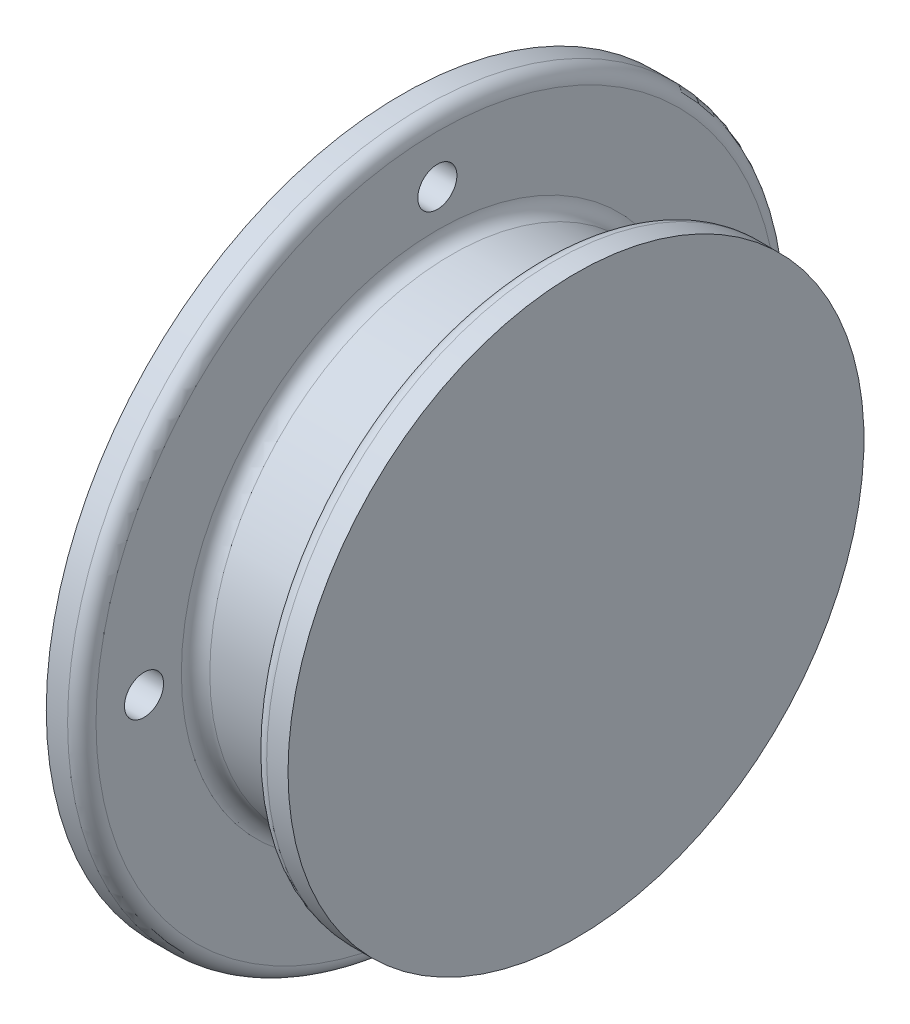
ISO-10303-21;
HEADER;
FILE_DESCRIPTION(('STEP AP214'),'2;1');
FILE_NAME('part.step','',(''),(''),'','','');
FILE_SCHEMA(('AUTOMOTIVE_DESIGN { 1 0 10303 214 1 1 1 1 }'));
ENDSEC;
DATA;
#1=APPLICATION_CONTEXT('core data for automotive mechanical design processes');
#2=APPLICATION_PROTOCOL_DEFINITION('international standard','automotive_design',2000,#1);
#3=PRODUCT_CONTEXT('',#1,'mechanical');
#4=PRODUCT('Part','Part','',(#3));
#5=PRODUCT_RELATED_PRODUCT_CATEGORY('part','',(#4));
#6=PRODUCT_DEFINITION_FORMATION('','',#4);
#7=PRODUCT_DEFINITION_CONTEXT('part definition',#1,'design');
#8=PRODUCT_DEFINITION('design','',#6,#7);
#9=PRODUCT_DEFINITION_SHAPE('','',#8);
#10=(LENGTH_UNIT() NAMED_UNIT(*) SI_UNIT(.MILLI.,.METRE.));
#11=(NAMED_UNIT(*) PLANE_ANGLE_UNIT() SI_UNIT($,.RADIAN.));
#12=(NAMED_UNIT(*) SI_UNIT($,.STERADIAN.) SOLID_ANGLE_UNIT());
#13=UNCERTAINTY_MEASURE_WITH_UNIT(LENGTH_MEASURE(1.E-05),#10,'distance_accuracy_value','');
#14=(GEOMETRIC_REPRESENTATION_CONTEXT(3) GLOBAL_UNCERTAINTY_ASSIGNED_CONTEXT((#13)) GLOBAL_UNIT_ASSIGNED_CONTEXT((#10,
#11,#12)) REPRESENTATION_CONTEXT('',''));
#15=CARTESIAN_POINT('',(0.,0.,0.));
#16=DIRECTION('',(0.,0.,1.));
#17=DIRECTION('',(1.,0.,0.));
#18=AXIS2_PLACEMENT_3D('',#15,#16,#17);
#19=CARTESIAN_POINT('',(423.5,0.,-15.9000000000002));
#20=DIRECTION('',(-1.,0.,0.));
#21=DIRECTION('',(0.,0.,1.));
#22=AXIS2_PLACEMENT_3D('',#19,#20,#21);
#23=PLANE('',#22);
#24=CARTESIAN_POINT('',(423.5,0.,-15.9000000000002));
#25=DIRECTION('',(-1.,0.,0.));
#26=DIRECTION('',(0.,0.,1.));
#27=AXIS2_PLACEMENT_3D('',#24,#25,#26);
#28=CIRCLE('',#27,65.);
#29=CARTESIAN_POINT('',(423.5,0.,49.0999999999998));
#30=VERTEX_POINT('',#29);
#31=EDGE_CURVE('E18',#30,#30,#28,.F.);
#32=ORIENTED_EDGE('',*,*,#31,.F.);
#33=EDGE_LOOP('',(#32));
#34=FACE_BOUND('',#33,.T.);
#35=ADVANCED_FACE('F14',(#34),#23,.T.);
#36=CARTESIAN_POINT('',(425.25,0.,-15.9000000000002));
#37=DIRECTION('',(-1.,0.,0.));
#38=DIRECTION('',(0.,0.,1.));
#39=AXIS2_PLACEMENT_3D('',#36,#37,#38);
#40=CYLINDRICAL_SURFACE('',#39,65.);
#41=CARTESIAN_POINT('',(427.,0.,-15.9000000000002));
#42=DIRECTION('',(-1.,0.,0.));
#43=DIRECTION('',(0.,0.,1.));
#44=AXIS2_PLACEMENT_3D('',#41,#42,#43);
#45=CIRCLE('',#44,65.);
#46=CARTESIAN_POINT('',(427.,0.,49.0999999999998));
#47=VERTEX_POINT('',#46);
#48=EDGE_CURVE('E60',#47,#47,#45,.F.);
#49=ORIENTED_EDGE('',*,*,#48,.F.);
#50=EDGE_LOOP('',(#49));
#51=FACE_BOUND('',#50,.T.);
#52=ORIENTED_EDGE('',*,*,#31,.T.);
#53=EDGE_LOOP('',(#52));
#54=FACE_BOUND('',#53,.T.);
#55=ADVANCED_FACE('F67',(#51,#54),#40,.T.);
#56=CARTESIAN_POINT('',(427.,0.,-15.9000000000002));
#57=DIRECTION('',(-1.,0.,0.));
#58=DIRECTION('',(0.,0.,1.));
#59=AXIS2_PLACEMENT_3D('',#56,#57,#58);
#60=PLANE('',#59);
#61=CARTESIAN_POINT('',(427.,0.,-15.9000000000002));
#62=DIRECTION('',(-1.,0.,0.));
#63=DIRECTION('',(0.,0.,1.));
#64=AXIS2_PLACEMENT_3D('',#61,#62,#63);
#65=CIRCLE('',#64,100.);
#66=CARTESIAN_POINT('',(427.,0.,84.0999999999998));
#67=VERTEX_POINT('',#66);
#68=EDGE_CURVE('E58',#67,#67,#65,.F.);
#69=ORIENTED_EDGE('',*,*,#68,.F.);
#70=EDGE_LOOP('',(#69));
#71=FACE_BOUND('',#70,.T.);
#72=ORIENTED_EDGE('',*,*,#48,.T.);
#73=EDGE_LOOP('',(#72));
#74=FACE_BOUND('',#73,.T.);
#75=CARTESIAN_POINT('',(427.,0.,66.5999999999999));
#76=DIRECTION('',(1.,0.,0.));
#77=DIRECTION('',(0.,0.,-1.));
#78=AXIS2_PLACEMENT_3D('',#75,#76,#77);
#79=CIRCLE('',#78,5.5);
#80=CARTESIAN_POINT('',(427.,0.,61.0999999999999));
#81=VERTEX_POINT('',#80);
#82=EDGE_CURVE('E46',#81,#81,#79,.T.);
#83=ORIENTED_EDGE('',*,*,#82,.T.);
#84=EDGE_LOOP('',(#83));
#85=FACE_BOUND('',#84,.T.);
#86=CARTESIAN_POINT('',(427.,82.4999999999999,-15.9000000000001));
#87=DIRECTION('',(1.,0.,0.));
#88=DIRECTION('',(0.,0.,-1.));
#89=AXIS2_PLACEMENT_3D('',#86,#87,#88);
#90=CIRCLE('',#89,5.5);
#91=CARTESIAN_POINT('',(427.,82.4999999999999,-21.4000000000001));
#92=VERTEX_POINT('',#91);
#93=EDGE_CURVE('E49',#92,#92,#90,.T.);
#94=ORIENTED_EDGE('',*,*,#93,.T.);
#95=EDGE_LOOP('',(#94));
#96=FACE_BOUND('',#95,.T.);
#97=CARTESIAN_POINT('',(427.,0.,-98.4));
#98=DIRECTION('',(1.,0.,0.));
#99=DIRECTION('',(0.,0.,-1.));
#100=AXIS2_PLACEMENT_3D('',#97,#98,#99);
#101=CIRCLE('',#100,5.49999999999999);
#102=CARTESIAN_POINT('',(427.,0.,-103.9));
#103=VERTEX_POINT('',#102);
#104=EDGE_CURVE('E52',#103,#103,#101,.T.);
#105=ORIENTED_EDGE('',*,*,#104,.T.);
#106=EDGE_LOOP('',(#105));
#107=FACE_BOUND('',#106,.T.);
#108=CARTESIAN_POINT('',(427.,-82.5000000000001,-15.9000000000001));
#109=DIRECTION('',(1.,0.,0.));
#110=DIRECTION('',(0.,0.,-1.));
#111=AXIS2_PLACEMENT_3D('',#108,#109,#110);
#112=CIRCLE('',#111,5.5);
#113=CARTESIAN_POINT('',(427.,-82.5000000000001,-21.4000000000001));
#114=VERTEX_POINT('',#113);
#115=EDGE_CURVE('E55',#114,#114,#112,.T.);
#116=ORIENTED_EDGE('',*,*,#115,.T.);
#117=EDGE_LOOP('',(#116));
#118=FACE_BOUND('',#117,.T.);
#119=ADVANCED_FACE('F75',(#71,#74,#85,#96,#107,#118),#60,.T.);
#120=CARTESIAN_POINT('',(430.,0.,-15.9000000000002));
#121=DIRECTION('',(-1.,0.,0.));
#122=DIRECTION('',(0.,0.,1.));
#123=AXIS2_PLACEMENT_3D('',#120,#121,#122);
#124=CYLINDRICAL_SURFACE('',#123,100.);
#125=CARTESIAN_POINT('',(433.,0.,-15.9000000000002));
#126=DIRECTION('',(-1.,0.,0.));
#127=DIRECTION('',(0.,0.,1.));
#128=AXIS2_PLACEMENT_3D('',#125,#126,#127);
#129=CIRCLE('',#128,100.);
#130=CARTESIAN_POINT('',(433.,0.,84.0999999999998));
#131=VERTEX_POINT('',#130);
#132=EDGE_CURVE('E31',#131,#131,#129,.F.);
#133=ORIENTED_EDGE('',*,*,#132,.F.);
#134=EDGE_LOOP('',(#133));
#135=FACE_BOUND('',#134,.T.);
#136=ORIENTED_EDGE('',*,*,#68,.T.);
#137=EDGE_LOOP('',(#136));
#138=FACE_BOUND('',#137,.T.);
#139=ADVANCED_FACE('F205',(#135,#138),#124,.T.);
#140=CARTESIAN_POINT('',(432.,-82.5000000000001,-15.9000000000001));
#141=DIRECTION('',(1.,0.,0.));
#142=DIRECTION('',(0.,0.,-1.));
#143=AXIS2_PLACEMENT_3D('',#140,#141,#142);
#144=CYLINDRICAL_SURFACE('',#143,5.5);
#145=CARTESIAN_POINT('',(437.,-82.5000000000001,-15.9000000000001));
#146=DIRECTION('',(1.,0.,0.));
#147=DIRECTION('',(0.,0.,-1.));
#148=AXIS2_PLACEMENT_3D('',#145,#146,#147);
#149=CIRCLE('',#148,5.5);
#150=CARTESIAN_POINT('',(437.,-82.5000000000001,-21.4000000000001));
#151=VERTEX_POINT('',#150);
#152=EDGE_CURVE('E43',#151,#151,#149,.F.);
#153=ORIENTED_EDGE('',*,*,#152,.F.);
#154=EDGE_LOOP('',(#153));
#155=FACE_BOUND('',#154,.T.);
#156=ORIENTED_EDGE('',*,*,#115,.F.);
#157=EDGE_LOOP('',(#156));
#158=FACE_BOUND('',#157,.T.);
#159=ADVANCED_FACE('F199',(#155,#158),#144,.F.);
#160=CARTESIAN_POINT('',(432.,0.,-98.4));
#161=DIRECTION('',(1.,0.,0.));
#162=DIRECTION('',(0.,0.,-1.));
#163=AXIS2_PLACEMENT_3D('',#160,#161,#162);
#164=CYLINDRICAL_SURFACE('',#163,5.49999999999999);
#165=CARTESIAN_POINT('',(437.,0.,-98.4));
#166=DIRECTION('',(1.,0.,0.));
#167=DIRECTION('',(0.,0.,-1.));
#168=AXIS2_PLACEMENT_3D('',#165,#166,#167);
#169=CIRCLE('',#168,5.49999999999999);
#170=CARTESIAN_POINT('',(437.,0.,-103.9));
#171=VERTEX_POINT('',#170);
#172=EDGE_CURVE('E40',#171,#171,#169,.F.);
#173=ORIENTED_EDGE('',*,*,#172,.F.);
#174=EDGE_LOOP('',(#173));
#175=FACE_BOUND('',#174,.T.);
#176=ORIENTED_EDGE('',*,*,#104,.F.);
#177=EDGE_LOOP('',(#176));
#178=FACE_BOUND('',#177,.T.);
#179=ADVANCED_FACE('F193',(#175,#178),#164,.F.);
#180=CARTESIAN_POINT('',(432.,82.4999999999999,-15.9000000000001));
#181=DIRECTION('',(1.,0.,0.));
#182=DIRECTION('',(0.,0.,-1.));
#183=AXIS2_PLACEMENT_3D('',#180,#181,#182);
#184=CYLINDRICAL_SURFACE('',#183,5.5);
#185=CARTESIAN_POINT('',(437.,82.4999999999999,-15.9000000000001));
#186=DIRECTION('',(1.,0.,0.));
#187=DIRECTION('',(0.,0.,-1.));
#188=AXIS2_PLACEMENT_3D('',#185,#186,#187);
#189=CIRCLE('',#188,5.5);
#190=CARTESIAN_POINT('',(437.,82.4999999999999,-21.4000000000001));
#191=VERTEX_POINT('',#190);
#192=EDGE_CURVE('E37',#191,#191,#189,.F.);
#193=ORIENTED_EDGE('',*,*,#192,.F.);
#194=EDGE_LOOP('',(#193));
#195=FACE_BOUND('',#194,.T.);
#196=ORIENTED_EDGE('',*,*,#93,.F.);
#197=EDGE_LOOP('',(#196));
#198=FACE_BOUND('',#197,.T.);
#199=ADVANCED_FACE('F187',(#195,#198),#184,.F.);
#200=CARTESIAN_POINT('',(432.,0.,66.6));
#201=DIRECTION('',(1.,0.,0.));
#202=DIRECTION('',(0.,0.,-1.));
#203=AXIS2_PLACEMENT_3D('',#200,#201,#202);
#204=CYLINDRICAL_SURFACE('',#203,5.5);
#205=CARTESIAN_POINT('',(437.,0.,66.6));
#206=DIRECTION('',(1.,0.,0.));
#207=DIRECTION('',(0.,0.,-1.));
#208=AXIS2_PLACEMENT_3D('',#205,#206,#207);
#209=CIRCLE('',#208,5.5);
#210=CARTESIAN_POINT('',(437.,0.,61.1));
#211=VERTEX_POINT('',#210);
#212=EDGE_CURVE('E33',#211,#211,#209,.F.);
#213=ORIENTED_EDGE('',*,*,#212,.F.);
#214=EDGE_LOOP('',(#213));
#215=FACE_BOUND('',#214,.T.);
#216=ORIENTED_EDGE('',*,*,#82,.F.);
#217=EDGE_LOOP('',(#216));
#218=FACE_BOUND('',#217,.T.);
#219=ADVANCED_FACE('F181',(#215,#218),#204,.F.);
#220=CARTESIAN_POINT('',(433.,0.,-15.9000000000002));
#221=DIRECTION('',(-1.,0.,0.));
#222=DIRECTION('',(0.,0.,1.));
#223=AXIS2_PLACEMENT_3D('',#220,#221,#222);
#224=TOROIDAL_SURFACE('',#223,96.0000000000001,4.);
#225=ORIENTED_EDGE('',*,*,#132,.T.);
#226=EDGE_LOOP('',(#225));
#227=FACE_BOUND('',#226,.T.);
#228=CARTESIAN_POINT('',(437.,0.,-15.9000000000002));
#229=DIRECTION('',(-1.,0.,0.));
#230=DIRECTION('',(0.,0.,1.));
#231=AXIS2_PLACEMENT_3D('',#228,#229,#230);
#232=CIRCLE('',#231,96.0000000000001);
#233=CARTESIAN_POINT('',(437.,-1.23810683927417E-13,80.0999999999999));
#234=VERTEX_POINT('',#233);
#235=EDGE_CURVE('E36',#234,#234,#232,.F.);
#236=ORIENTED_EDGE('',*,*,#235,.F.);
#237=EDGE_LOOP('',(#236));
#238=FACE_BOUND('',#237,.T.);
#239=ADVANCED_FACE('F175',(#227,#238),#224,.T.);
#240=CARTESIAN_POINT('',(437.,0.,-15.9000000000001));
#241=DIRECTION('',(1.,0.,0.));
#242=DIRECTION('',(0.,0.,-1.));
#243=AXIS2_PLACEMENT_3D('',#240,#241,#242);
#244=PLANE('',#243);
#245=ORIENTED_EDGE('',*,*,#235,.T.);
#246=EDGE_LOOP('',(#245));
#247=FACE_BOUND('',#246,.T.);
#248=CARTESIAN_POINT('',(437.,0.,-15.9000000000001));
#249=DIRECTION('',(1.,0.,0.));
#250=DIRECTION('',(0.,0.,1.));
#251=AXIS2_PLACEMENT_3D('',#248,#249,#250);
#252=CIRCLE('',#251,72.);
#253=CARTESIAN_POINT('',(437.,0.,56.0999999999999));
#254=VERTEX_POINT('',#253);
#255=EDGE_CURVE('E226',#254,#254,#252,.F.);
#256=ORIENTED_EDGE('',*,*,#255,.T.);
#257=EDGE_LOOP('',(#256));
#258=FACE_BOUND('',#257,.T.);
#259=ORIENTED_EDGE('',*,*,#212,.T.);
#260=EDGE_LOOP('',(#259));
#261=FACE_BOUND('',#260,.T.);
#262=ORIENTED_EDGE('',*,*,#192,.T.);
#263=EDGE_LOOP('',(#262));
#264=FACE_BOUND('',#263,.T.);
#265=ORIENTED_EDGE('',*,*,#172,.T.);
#266=EDGE_LOOP('',(#265));
#267=FACE_BOUND('',#266,.T.);
#268=ORIENTED_EDGE('',*,*,#152,.T.);
#269=EDGE_LOOP('',(#268));
#270=FACE_BOUND('',#269,.T.);
#271=ADVANCED_FACE('F170',(#247,#258,#261,#264,#267,#270),#244,.T.);
#272=CARTESIAN_POINT('',(441.,0.,-15.9000000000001));
#273=DIRECTION('',(-1.,0.,0.));
#274=DIRECTION('',(0.,0.,1.));
#275=AXIS2_PLACEMENT_3D('',#272,#273,#274);
#276=TOROIDAL_SURFACE('',#275,72.,4.);
#277=CARTESIAN_POINT('',(441.,0.,-15.9000000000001));
#278=DIRECTION('',(-1.,0.,0.));
#279=DIRECTION('',(0.,0.,1.));
#280=AXIS2_PLACEMENT_3D('',#277,#278,#279);
#281=CIRCLE('',#280,68.);
#282=CARTESIAN_POINT('',(441.,0.,52.0999999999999));
#283=VERTEX_POINT('',#282);
#284=EDGE_CURVE('E139',#283,#283,#281,.F.);
#285=ORIENTED_EDGE('',*,*,#284,.F.);
#286=EDGE_LOOP('',(#285));
#287=FACE_BOUND('',#286,.T.);
#288=ORIENTED_EDGE('',*,*,#255,.F.);
#289=EDGE_LOOP('',(#288));
#290=FACE_BOUND('',#289,.T.);
#291=ADVANCED_FACE('F165',(#287,#290),#276,.F.);
#292=CARTESIAN_POINT('',(451.5,0.,-15.9000000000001));
#293=DIRECTION('',(-1.,0.,0.));
#294=DIRECTION('',(0.,0.,1.));
#295=AXIS2_PLACEMENT_3D('',#292,#293,#294);
#296=CYLINDRICAL_SURFACE('',#295,68.);
#297=ORIENTED_EDGE('',*,*,#284,.T.);
#298=EDGE_LOOP('',(#297));
#299=FACE_BOUND('',#298,.T.);
#300=CARTESIAN_POINT('',(462.,0.,-15.9000000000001));
#301=DIRECTION('',(-1.,0.,0.));
#302=DIRECTION('',(0.,0.,1.));
#303=AXIS2_PLACEMENT_3D('',#300,#301,#302);
#304=CIRCLE('',#303,68.);
#305=CARTESIAN_POINT('',(462.,0.,52.1));
#306=VERTEX_POINT('',#305);
#307=EDGE_CURVE('E141',#306,#306,#304,.T.);
#308=ORIENTED_EDGE('',*,*,#307,.T.);
#309=EDGE_LOOP('',(#308));
#310=FACE_BOUND('',#309,.T.);
#311=ADVANCED_FACE('F134',(#299,#310),#296,.T.);
#312=CARTESIAN_POINT('',(462.,0.,-15.9000000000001));
#313=DIRECTION('',(-1.,0.,0.));
#314=DIRECTION('',(0.,0.,1.));
#315=AXIS2_PLACEMENT_3D('',#312,#313,#314);
#316=TOROIDAL_SURFACE('',#315,72.,4.);
#317=CARTESIAN_POINT('',(466.,0.,-15.9000000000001));
#318=DIRECTION('',(-1.,0.,0.));
#319=DIRECTION('',(0.,0.,1.));
#320=AXIS2_PLACEMENT_3D('',#317,#318,#319);
#321=CIRCLE('',#320,72.);
#322=CARTESIAN_POINT('',(466.,0.,56.0999999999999));
#323=VERTEX_POINT('',#322);
#324=EDGE_CURVE('E118',#323,#323,#321,.F.);
#325=ORIENTED_EDGE('',*,*,#324,.F.);
#326=EDGE_LOOP('',(#325));
#327=FACE_BOUND('',#326,.T.);
#328=ORIENTED_EDGE('',*,*,#307,.F.);
#329=EDGE_LOOP('',(#328));
#330=FACE_BOUND('',#329,.T.);
#331=ADVANCED_FACE('F124',(#327,#330),#316,.F.);
#332=CARTESIAN_POINT('',(466.,0.,-15.9000000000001));
#333=DIRECTION('',(-1.,0.,0.));
#334=DIRECTION('',(0.,0.,1.));
#335=AXIS2_PLACEMENT_3D('',#332,#333,#334);
#336=PLANE('',#335);
#337=CARTESIAN_POINT('',(466.,0.,-15.9000000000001));
#338=DIRECTION('',(1.,0.,0.));
#339=DIRECTION('',(0.,0.,1.));
#340=AXIS2_PLACEMENT_3D('',#337,#338,#339);
#341=CIRCLE('',#340,77.);
#342=CARTESIAN_POINT('',(466.,0.,61.0999999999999));
#343=VERTEX_POINT('',#342);
#344=EDGE_CURVE('E27',#343,#343,#341,.T.);
#345=ORIENTED_EDGE('',*,*,#344,.F.);
#346=EDGE_LOOP('',(#345));
#347=FACE_BOUND('',#346,.T.);
#348=ORIENTED_EDGE('',*,*,#324,.T.);
#349=EDGE_LOOP('',(#348));
#350=FACE_BOUND('',#349,.T.);
#351=ADVANCED_FACE('F88',(#347,#350),#336,.T.);
#352=CARTESIAN_POINT('',(470.,0.,-15.9000000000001));
#353=DIRECTION('',(-1.,0.,0.));
#354=DIRECTION('',(0.,0.,1.));
#355=AXIS2_PLACEMENT_3D('',#352,#353,#354);
#356=TOROIDAL_SURFACE('',#355,77.,4.);
#357=ORIENTED_EDGE('',*,*,#344,.T.);
#358=EDGE_LOOP('',(#357));
#359=FACE_BOUND('',#358,.T.);
#360=CARTESIAN_POINT('',(470.,0.,-15.9000000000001));
#361=DIRECTION('',(-1.,0.,0.));
#362=DIRECTION('',(0.,0.,1.));
#363=AXIS2_PLACEMENT_3D('',#360,#361,#362);
#364=CIRCLE('',#363,81.);
#365=CARTESIAN_POINT('',(470.,0.,65.0999999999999));
#366=VERTEX_POINT('',#365);
#367=EDGE_CURVE('E22',#366,#366,#364,.F.);
#368=ORIENTED_EDGE('',*,*,#367,.F.);
#369=EDGE_LOOP('',(#368));
#370=FACE_BOUND('',#369,.T.);
#371=ADVANCED_FACE('F83',(#359,#370),#356,.T.);
#372=CARTESIAN_POINT('',(473.,0.,-15.9000000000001));
#373=DIRECTION('',(-1.,0.,0.));
#374=DIRECTION('',(0.,0.,1.));
#375=AXIS2_PLACEMENT_3D('',#372,#373,#374);
#376=CYLINDRICAL_SURFACE('',#375,81.);
#377=CARTESIAN_POINT('',(476.,0.,-15.9000000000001));
#378=DIRECTION('',(-1.,0.,0.));
#379=DIRECTION('',(0.,0.,1.));
#380=AXIS2_PLACEMENT_3D('',#377,#378,#379);
#381=CIRCLE('',#380,81.);
#382=CARTESIAN_POINT('',(476.,0.,65.1));
#383=VERTEX_POINT('',#382);
#384=EDGE_CURVE('E10',#383,#383,#381,.F.);
#385=ORIENTED_EDGE('',*,*,#384,.F.);
#386=EDGE_LOOP('',(#385));
#387=FACE_BOUND('',#386,.T.);
#388=ORIENTED_EDGE('',*,*,#367,.T.);
#389=EDGE_LOOP('',(#388));
#390=FACE_BOUND('',#389,.T.);
#391=ADVANCED_FACE('F79',(#387,#390),#376,.T.);
#392=CARTESIAN_POINT('',(476.,0.,-15.9000000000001));
#393=DIRECTION('',(1.,0.,0.));
#394=DIRECTION('',(0.,0.,-1.));
#395=AXIS2_PLACEMENT_3D('',#392,#393,#394);
#396=PLANE('',#395);
#397=ORIENTED_EDGE('',*,*,#384,.T.);
#398=EDGE_LOOP('',(#397));
#399=FACE_BOUND('',#398,.T.);
#400=ADVANCED_FACE('F16',(#399),#396,.T.);
#401=CLOSED_SHELL('',(#35,#55,#119,#139,#159,#179,#199,#219,#239,#271,#291,#311,#331,#351,#371,
#391,#400));
#402=MANIFOLD_SOLID_BREP('B1',#401);
#403=ADVANCED_BREP_SHAPE_REPRESENTATION('',(#18,#402),#14);
#404=SHAPE_DEFINITION_REPRESENTATION(#9,#403);
ENDSEC;
END-ISO-10303-21;
